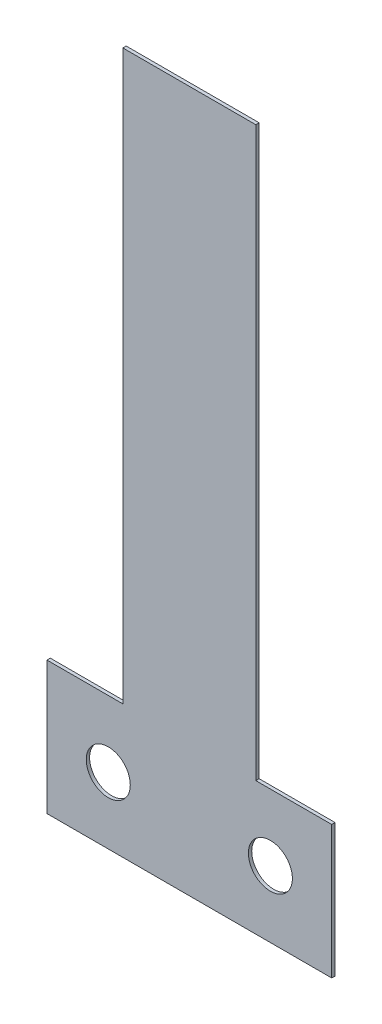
from build123d import *

# Parameters (mm, degrees)
SKETCH1_W           = 23.8252
SKETCH1_H           = 11.1252
BOSS_EXTRUDE1_DEPTH = 0.2794
SKETCH2_W           = 11.1252
SKETCH2_H           = 47.5234
BOSS_EXTRUDE2_DEPTH = 0.2794
SKETCH3_R           = 1.8415
CUT_EXTRUDE1_DEPTH  = 0.2794


with BuildPart() as part:
    # Sketch1 → Boss-Extrude1 (new body)
    with BuildSketch(Plane.XY):
        Rectangle(SKETCH1_W, SKETCH1_H)
    extrude(amount=BOSS_EXTRUDE1_DEPTH)

    # Sketch2 → Boss-Extrude2 (add)
    with BuildSketch(Plane.XY.offset(0.2794)):
        with Locations((0, 29.3243)):
            Rectangle(SKETCH2_W, SKETCH2_H)
    extrude(amount=-BOSS_EXTRUDE2_DEPTH)

    # Sketch3 → Cut-Extrude1 (cut)
    with BuildSketch(Plane.XY.offset(0.2794)):
        with Locations((-6.7818, 0)):
            Circle(SKETCH3_R)
        with Locations(Location((6.7818, 0, 0), (0, 0, 180))):
            Circle(SKETCH3_R)
    extrude(amount=-CUT_EXTRUDE1_DEPTH, mode=Mode.SUBTRACT)


solid = part.part
